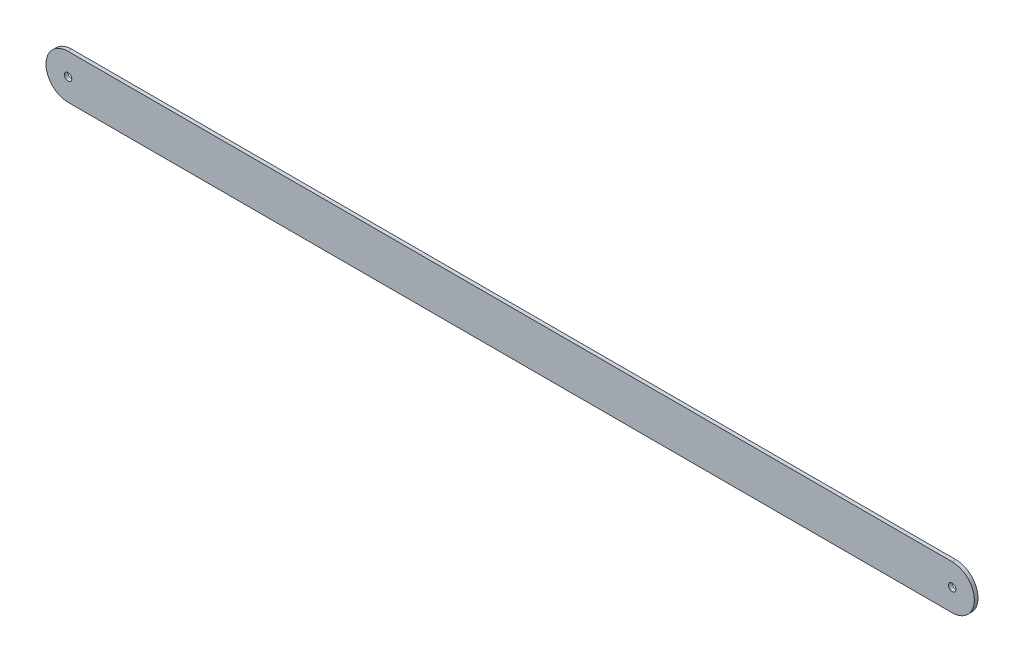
ISO-10303-21;
HEADER;
FILE_DESCRIPTION(('STEP AP214'),'2;1');
FILE_NAME('part.step','',(''),(''),'','','');
FILE_SCHEMA(('AUTOMOTIVE_DESIGN { 1 0 10303 214 1 1 1 1 }'));
ENDSEC;
DATA;
#1=APPLICATION_CONTEXT('core data for automotive mechanical design processes');
#2=APPLICATION_PROTOCOL_DEFINITION('international standard','automotive_design',2000,#1);
#3=PRODUCT_CONTEXT('',#1,'mechanical');
#4=PRODUCT('Part','Part','',(#3));
#5=PRODUCT_RELATED_PRODUCT_CATEGORY('part','',(#4));
#6=PRODUCT_DEFINITION_FORMATION('','',#4);
#7=PRODUCT_DEFINITION_CONTEXT('part definition',#1,'design');
#8=PRODUCT_DEFINITION('design','',#6,#7);
#9=PRODUCT_DEFINITION_SHAPE('','',#8);
#10=(LENGTH_UNIT() NAMED_UNIT(*) SI_UNIT(.MILLI.,.METRE.));
#11=(NAMED_UNIT(*) PLANE_ANGLE_UNIT() SI_UNIT($,.RADIAN.));
#12=(NAMED_UNIT(*) SI_UNIT($,.STERADIAN.) SOLID_ANGLE_UNIT());
#13=UNCERTAINTY_MEASURE_WITH_UNIT(LENGTH_MEASURE(1.E-05),#10,'distance_accuracy_value','');
#14=(GEOMETRIC_REPRESENTATION_CONTEXT(3) GLOBAL_UNCERTAINTY_ASSIGNED_CONTEXT((#13)) GLOBAL_UNIT_ASSIGNED_CONTEXT((#10,
#11,#12)) REPRESENTATION_CONTEXT('',''));
#15=CARTESIAN_POINT('',(0.,0.,0.));
#16=DIRECTION('',(0.,0.,1.));
#17=DIRECTION('',(1.,0.,0.));
#18=AXIS2_PLACEMENT_3D('',#15,#16,#17);
#19=CARTESIAN_POINT('',(0.,0.,1.));
#20=DIRECTION('',(0.,0.,1.));
#21=DIRECTION('',(1.,0.,0.));
#22=AXIS2_PLACEMENT_3D('',#19,#20,#21);
#23=PLANE('',#22);
#24=CARTESIAN_POINT('',(0.,0.,1.));
#25=DIRECTION('',(0.,0.,1.));
#26=DIRECTION('',(1.,0.,0.));
#27=AXIS2_PLACEMENT_3D('',#24,#25,#26);
#28=CIRCLE('',#27,1.);
#29=CARTESIAN_POINT('',(1.,0.,1.));
#30=VERTEX_POINT('',#29);
#31=EDGE_CURVE('E118',#30,#30,#28,.T.);
#32=ORIENTED_EDGE('',*,*,#31,.F.);
#33=EDGE_LOOP('',(#32));
#34=FACE_BOUND('',#33,.T.);
#35=CARTESIAN_POINT('',(0.,0.,1.));
#36=DIRECTION('',(0.,0.,1.));
#37=DIRECTION('',(1.,0.,0.));
#38=AXIS2_PLACEMENT_3D('',#35,#36,#37);
#39=CIRCLE('',#38,6.);
#40=CARTESIAN_POINT('',(0.,6.,1.));
#41=VERTEX_POINT('',#40);
#42=CARTESIAN_POINT('',(0.,-6.,1.));
#43=VERTEX_POINT('',#42);
#44=EDGE_CURVE('E98',#41,#43,#39,.T.);
#45=ORIENTED_EDGE('',*,*,#44,.T.);
#46=DIRECTION('',(1.,0.,0.));
#47=VECTOR('',#46,1.);
#48=CARTESIAN_POINT('',(0.,-6.,1.));
#49=LINE('',#48,#47);
#50=CARTESIAN_POINT('',(240.,-6.,1.));
#51=VERTEX_POINT('',#50);
#52=EDGE_CURVE('E93',#43,#51,#49,.T.);
#53=ORIENTED_EDGE('',*,*,#52,.T.);
#54=CARTESIAN_POINT('',(240.,0.,1.));
#55=DIRECTION('',(0.,0.,1.));
#56=DIRECTION('',(1.,0.,0.));
#57=AXIS2_PLACEMENT_3D('',#54,#55,#56);
#58=CIRCLE('',#57,6.);
#59=CARTESIAN_POINT('',(240.,6.,1.));
#60=VERTEX_POINT('',#59);
#61=EDGE_CURVE('E96',#51,#60,#58,.T.);
#62=ORIENTED_EDGE('',*,*,#61,.T.);
#63=DIRECTION('',(-1.,0.,0.));
#64=VECTOR('',#63,1.);
#65=CARTESIAN_POINT('',(0.,6.,1.));
#66=LINE('',#65,#64);
#67=EDGE_CURVE('E63',#60,#41,#66,.T.);
#68=ORIENTED_EDGE('',*,*,#67,.T.);
#69=EDGE_LOOP('',(#45,#53,#62,#68));
#70=FACE_BOUND('',#69,.T.);
#71=CARTESIAN_POINT('',(240.,0.,1.));
#72=DIRECTION('',(0.,0.,1.));
#73=DIRECTION('',(1.,0.,0.));
#74=AXIS2_PLACEMENT_3D('',#71,#72,#73);
#75=CIRCLE('',#74,0.999999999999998);
#76=CARTESIAN_POINT('',(241.,0.,1.));
#77=VERTEX_POINT('',#76);
#78=EDGE_CURVE('E140',#77,#77,#75,.T.);
#79=ORIENTED_EDGE('',*,*,#78,.F.);
#80=EDGE_LOOP('',(#79));
#81=FACE_BOUND('',#80,.T.);
#82=ADVANCED_FACE('F45',(#34,#70,#81),#23,.T.);
#83=CARTESIAN_POINT('',(0.,0.,0.));
#84=DIRECTION('',(0.,0.,1.));
#85=DIRECTION('',(1.,0.,0.));
#86=AXIS2_PLACEMENT_3D('',#83,#84,#85);
#87=PLANE('',#86);
#88=CARTESIAN_POINT('',(0.,0.,0.));
#89=DIRECTION('',(0.,0.,1.));
#90=DIRECTION('',(1.,0.,0.));
#91=AXIS2_PLACEMENT_3D('',#88,#89,#90);
#92=CIRCLE('',#91,6.);
#93=CARTESIAN_POINT('',(0.,6.,0.));
#94=VERTEX_POINT('',#93);
#95=CARTESIAN_POINT('',(0.,-6.,0.));
#96=VERTEX_POINT('',#95);
#97=EDGE_CURVE('E114',#94,#96,#92,.T.);
#98=ORIENTED_EDGE('',*,*,#97,.F.);
#99=DIRECTION('',(-1.,0.,0.));
#100=VECTOR('',#99,1.);
#101=CARTESIAN_POINT('',(0.,6.,0.));
#102=LINE('',#101,#100);
#103=CARTESIAN_POINT('',(240.,6.,0.));
#104=VERTEX_POINT('',#103);
#105=EDGE_CURVE('E86',#104,#94,#102,.T.);
#106=ORIENTED_EDGE('',*,*,#105,.F.);
#107=CARTESIAN_POINT('',(240.,0.,0.));
#108=DIRECTION('',(0.,0.,1.));
#109=DIRECTION('',(1.,0.,0.));
#110=AXIS2_PLACEMENT_3D('',#107,#108,#109);
#111=CIRCLE('',#110,6.);
#112=CARTESIAN_POINT('',(240.,-6.,0.));
#113=VERTEX_POINT('',#112);
#114=EDGE_CURVE('E80',#113,#104,#111,.T.);
#115=ORIENTED_EDGE('',*,*,#114,.F.);
#116=DIRECTION('',(1.,0.,0.));
#117=VECTOR('',#116,1.);
#118=CARTESIAN_POINT('',(0.,-6.,0.));
#119=LINE('',#118,#117);
#120=EDGE_CURVE('E103',#96,#113,#119,.T.);
#121=ORIENTED_EDGE('',*,*,#120,.F.);
#122=EDGE_LOOP('',(#98,#106,#115,#121));
#123=FACE_BOUND('',#122,.T.);
#124=CARTESIAN_POINT('',(0.,0.,0.));
#125=DIRECTION('',(0.,0.,1.));
#126=DIRECTION('',(1.,0.,0.));
#127=AXIS2_PLACEMENT_3D('',#124,#125,#126);
#128=CIRCLE('',#127,1.);
#129=CARTESIAN_POINT('',(1.,0.,0.));
#130=VERTEX_POINT('',#129);
#131=EDGE_CURVE('E136',#130,#130,#128,.T.);
#132=ORIENTED_EDGE('',*,*,#131,.T.);
#133=EDGE_LOOP('',(#132));
#134=FACE_BOUND('',#133,.T.);
#135=CARTESIAN_POINT('',(240.,0.,0.));
#136=DIRECTION('',(0.,0.,1.));
#137=DIRECTION('',(1.,0.,0.));
#138=AXIS2_PLACEMENT_3D('',#135,#136,#137);
#139=CIRCLE('',#138,0.999999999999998);
#140=CARTESIAN_POINT('',(241.,0.,0.));
#141=VERTEX_POINT('',#140);
#142=EDGE_CURVE('E144',#141,#141,#139,.T.);
#143=ORIENTED_EDGE('',*,*,#142,.T.);
#144=EDGE_LOOP('',(#143));
#145=FACE_BOUND('',#144,.T.);
#146=ADVANCED_FACE('F131',(#123,#134,#145),#87,.F.);
#147=CARTESIAN_POINT('',(0.,0.,1.));
#148=DIRECTION('',(0.,0.,-1.));
#149=DIRECTION('',(-1.,0.,0.));
#150=AXIS2_PLACEMENT_3D('',#147,#148,#149);
#151=CYLINDRICAL_SURFACE('',#150,6.);
#152=ORIENTED_EDGE('',*,*,#97,.T.);
#153=DIRECTION('',(0.,0.,-1.));
#154=VECTOR('',#153,1.);
#155=CARTESIAN_POINT('',(0.,-6.,1.));
#156=LINE('',#155,#154);
#157=EDGE_CURVE('E11',#43,#96,#156,.T.);
#158=ORIENTED_EDGE('',*,*,#157,.F.);
#159=ORIENTED_EDGE('',*,*,#44,.F.);
#160=DIRECTION('',(0.,0.,-1.));
#161=VECTOR('',#160,1.);
#162=CARTESIAN_POINT('',(0.,6.,1.));
#163=LINE('',#162,#161);
#164=EDGE_CURVE('E110',#41,#94,#163,.T.);
#165=ORIENTED_EDGE('',*,*,#164,.T.);
#166=EDGE_LOOP('',(#152,#158,#159,#165));
#167=FACE_BOUND('',#166,.T.);
#168=ADVANCED_FACE('F47',(#167),#151,.T.);
#169=CARTESIAN_POINT('',(0.,-6.,1.));
#170=DIRECTION('',(0.,1.,0.));
#171=DIRECTION('',(0.,0.,1.));
#172=AXIS2_PLACEMENT_3D('',#169,#170,#171);
#173=PLANE('',#172);
#174=ORIENTED_EDGE('',*,*,#120,.T.);
#175=DIRECTION('',(0.,0.,-1.));
#176=VECTOR('',#175,1.);
#177=CARTESIAN_POINT('',(240.,-6.,1.));
#178=LINE('',#177,#176);
#179=EDGE_CURVE('E55',#51,#113,#178,.T.);
#180=ORIENTED_EDGE('',*,*,#179,.F.);
#181=ORIENTED_EDGE('',*,*,#52,.F.);
#182=ORIENTED_EDGE('',*,*,#157,.T.);
#183=EDGE_LOOP('',(#174,#180,#181,#182));
#184=FACE_BOUND('',#183,.T.);
#185=ADVANCED_FACE('F102',(#184),#173,.F.);
#186=CARTESIAN_POINT('',(240.,0.,1.));
#187=DIRECTION('',(0.,0.,-1.));
#188=DIRECTION('',(-1.,0.,0.));
#189=AXIS2_PLACEMENT_3D('',#186,#187,#188);
#190=CYLINDRICAL_SURFACE('',#189,6.);
#191=ORIENTED_EDGE('',*,*,#114,.T.);
#192=DIRECTION('',(0.,0.,-1.));
#193=VECTOR('',#192,1.);
#194=CARTESIAN_POINT('',(240.,6.,1.));
#195=LINE('',#194,#193);
#196=EDGE_CURVE('E105',#60,#104,#195,.T.);
#197=ORIENTED_EDGE('',*,*,#196,.F.);
#198=ORIENTED_EDGE('',*,*,#61,.F.);
#199=ORIENTED_EDGE('',*,*,#179,.T.);
#200=EDGE_LOOP('',(#191,#197,#198,#199));
#201=FACE_BOUND('',#200,.T.);
#202=ADVANCED_FACE('F106',(#201),#190,.T.);
#203=CARTESIAN_POINT('',(0.,6.,1.));
#204=DIRECTION('',(0.,-1.,0.));
#205=DIRECTION('',(0.,0.,-1.));
#206=AXIS2_PLACEMENT_3D('',#203,#204,#205);
#207=PLANE('',#206);
#208=ORIENTED_EDGE('',*,*,#105,.T.);
#209=ORIENTED_EDGE('',*,*,#164,.F.);
#210=ORIENTED_EDGE('',*,*,#67,.F.);
#211=ORIENTED_EDGE('',*,*,#196,.T.);
#212=EDGE_LOOP('',(#208,#209,#210,#211));
#213=FACE_BOUND('',#212,.T.);
#214=ADVANCED_FACE('F128',(#213),#207,.F.);
#215=CARTESIAN_POINT('',(0.,0.,1.));
#216=DIRECTION('',(0.,0.,-1.));
#217=DIRECTION('',(-1.,0.,0.));
#218=AXIS2_PLACEMENT_3D('',#215,#216,#217);
#219=CYLINDRICAL_SURFACE('',#218,1.);
#220=ORIENTED_EDGE('',*,*,#31,.T.);
#221=EDGE_LOOP('',(#220));
#222=FACE_BOUND('',#221,.T.);
#223=ORIENTED_EDGE('',*,*,#131,.F.);
#224=EDGE_LOOP('',(#223));
#225=FACE_BOUND('',#224,.T.);
#226=ADVANCED_FACE('F163',(#222,#225),#219,.F.);
#227=CARTESIAN_POINT('',(240.,0.,1.));
#228=DIRECTION('',(0.,0.,-1.));
#229=DIRECTION('',(-1.,0.,0.));
#230=AXIS2_PLACEMENT_3D('',#227,#228,#229);
#231=CYLINDRICAL_SURFACE('',#230,0.999999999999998);
#232=ORIENTED_EDGE('',*,*,#78,.T.);
#233=EDGE_LOOP('',(#232));
#234=FACE_BOUND('',#233,.T.);
#235=ORIENTED_EDGE('',*,*,#142,.F.);
#236=EDGE_LOOP('',(#235));
#237=FACE_BOUND('',#236,.T.);
#238=ADVANCED_FACE('F152',(#234,#237),#231,.F.);
#239=CLOSED_SHELL('',(#82,#146,#168,#185,#202,#214,#226,#238));
#240=MANIFOLD_SOLID_BREP('B2',#239);
#241=ADVANCED_BREP_SHAPE_REPRESENTATION('',(#18,#240),#14);
#242=SHAPE_DEFINITION_REPRESENTATION(#9,#241);
ENDSEC;
END-ISO-10303-21;
